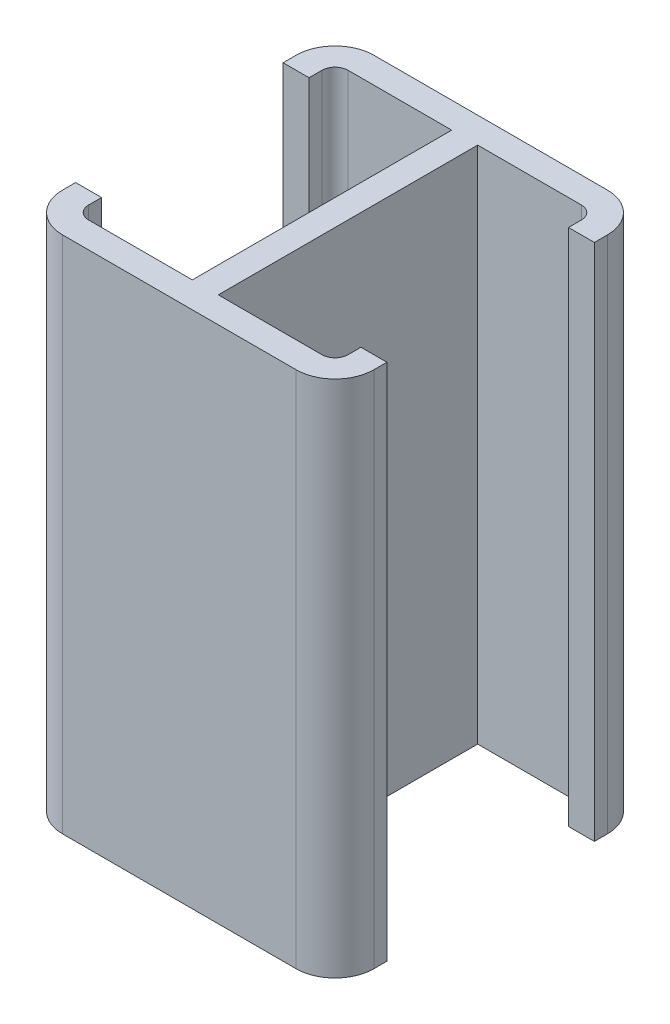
ISO-10303-21;
HEADER;
FILE_DESCRIPTION(('STEP AP214'),'2;1');
FILE_NAME('part.step','',(''),(''),'','','');
FILE_SCHEMA(('AUTOMOTIVE_DESIGN { 1 0 10303 214 1 1 1 1 }'));
ENDSEC;
DATA;
#1=APPLICATION_CONTEXT('core data for automotive mechanical design processes');
#2=APPLICATION_PROTOCOL_DEFINITION('international standard','automotive_design',2000,#1);
#3=PRODUCT_CONTEXT('',#1,'mechanical');
#4=PRODUCT('Part','Part','',(#3));
#5=PRODUCT_RELATED_PRODUCT_CATEGORY('part','',(#4));
#6=PRODUCT_DEFINITION_FORMATION('','',#4);
#7=PRODUCT_DEFINITION_CONTEXT('part definition',#1,'design');
#8=PRODUCT_DEFINITION('design','',#6,#7);
#9=PRODUCT_DEFINITION_SHAPE('','',#8);
#10=(LENGTH_UNIT() NAMED_UNIT(*) SI_UNIT(.MILLI.,.METRE.));
#11=(NAMED_UNIT(*) PLANE_ANGLE_UNIT() SI_UNIT($,.RADIAN.));
#12=(NAMED_UNIT(*) SI_UNIT($,.STERADIAN.) SOLID_ANGLE_UNIT());
#13=UNCERTAINTY_MEASURE_WITH_UNIT(LENGTH_MEASURE(1.E-05),#10,'distance_accuracy_value','');
#14=(GEOMETRIC_REPRESENTATION_CONTEXT(3) GLOBAL_UNCERTAINTY_ASSIGNED_CONTEXT((#13)) GLOBAL_UNIT_ASSIGNED_CONTEXT((#10,
#11,#12)) REPRESENTATION_CONTEXT('',''));
#15=CARTESIAN_POINT('',(0.,0.,0.));
#16=DIRECTION('',(0.,0.,1.));
#17=DIRECTION('',(1.,0.,0.));
#18=AXIS2_PLACEMENT_3D('',#15,#16,#17);
#19=CARTESIAN_POINT('',(0.,200.,60.));
#20=DIRECTION('',(0.,0.,-1.));
#21=DIRECTION('',(-1.,0.,0.));
#22=AXIS2_PLACEMENT_3D('',#19,#20,#21);
#23=PLANE('',#22);
#24=DIRECTION('',(1.,0.,0.));
#25=VECTOR('',#24,1.);
#26=CARTESIAN_POINT('',(0.,0.,60.));
#27=LINE('',#26,#25);
#28=CARTESIAN_POINT('',(-45.,0.,60.));
#29=VERTEX_POINT('',#28);
#30=CARTESIAN_POINT('',(45.,0.,60.));
#31=VERTEX_POINT('',#30);
#32=EDGE_CURVE('E129',#29,#31,#27,.T.);
#33=ORIENTED_EDGE('',*,*,#32,.T.);
#34=DIRECTION('',(0.,-1.,0.));
#35=VECTOR('',#34,1.);
#36=CARTESIAN_POINT('',(45.,200.,60.));
#37=LINE('',#36,#35);
#38=CARTESIAN_POINT('',(45.,200.,60.));
#39=VERTEX_POINT('',#38);
#40=EDGE_CURVE('E11',#39,#31,#37,.T.);
#41=ORIENTED_EDGE('',*,*,#40,.F.);
#42=DIRECTION('',(1.,0.,0.));
#43=VECTOR('',#42,1.);
#44=CARTESIAN_POINT('',(0.,200.,60.));
#45=LINE('',#44,#43);
#46=CARTESIAN_POINT('',(-45.,200.,60.));
#47=VERTEX_POINT('',#46);
#48=EDGE_CURVE('E89',#47,#39,#45,.T.);
#49=ORIENTED_EDGE('',*,*,#48,.F.);
#50=DIRECTION('',(0.,-1.,0.));
#51=VECTOR('',#50,1.);
#52=CARTESIAN_POINT('',(-45.,200.,60.));
#53=LINE('',#52,#51);
#54=EDGE_CURVE('E132',#47,#29,#53,.T.);
#55=ORIENTED_EDGE('',*,*,#54,.T.);
#56=EDGE_LOOP('',(#33,#41,#49,#55));
#57=FACE_BOUND('',#56,.T.);
#58=ADVANCED_FACE('F32',(#57),#23,.F.);
#59=CARTESIAN_POINT('',(45.,200.,45.));
#60=DIRECTION('',(0.,-1.,0.));
#61=DIRECTION('',(0.,0.,-1.));
#62=AXIS2_PLACEMENT_3D('',#59,#60,#61);
#63=CYLINDRICAL_SURFACE('',#62,15.);
#64=CARTESIAN_POINT('',(45.,0.,45.));
#65=DIRECTION('',(0.,1.,0.));
#66=DIRECTION('',(0.,0.,-1.));
#67=AXIS2_PLACEMENT_3D('',#64,#65,#66);
#68=CIRCLE('',#67,15.);
#69=CARTESIAN_POINT('',(60.,0.,45.));
#70=VERTEX_POINT('',#69);
#71=EDGE_CURVE('E131',#31,#70,#68,.T.);
#72=ORIENTED_EDGE('',*,*,#71,.T.);
#73=DIRECTION('',(0.,-1.,0.));
#74=VECTOR('',#73,1.);
#75=CARTESIAN_POINT('',(60.,200.,45.));
#76=LINE('',#75,#74);
#77=CARTESIAN_POINT('',(60.,200.,45.));
#78=VERTEX_POINT('',#77);
#79=EDGE_CURVE('E40',#78,#70,#76,.T.);
#80=ORIENTED_EDGE('',*,*,#79,.F.);
#81=CARTESIAN_POINT('',(45.,200.,45.));
#82=DIRECTION('',(0.,1.,0.));
#83=DIRECTION('',(0.,0.,-1.));
#84=AXIS2_PLACEMENT_3D('',#81,#82,#83);
#85=CIRCLE('',#84,15.);
#86=EDGE_CURVE('E167',#39,#78,#85,.T.);
#87=ORIENTED_EDGE('',*,*,#86,.F.);
#88=ORIENTED_EDGE('',*,*,#40,.T.);
#89=EDGE_LOOP('',(#72,#80,#87,#88));
#90=FACE_BOUND('',#89,.T.);
#91=ADVANCED_FACE('F512',(#90),#63,.T.);
#92=CARTESIAN_POINT('',(60.,200.,45.));
#93=DIRECTION('',(-1.,0.,0.));
#94=DIRECTION('',(0.,0.,1.));
#95=AXIS2_PLACEMENT_3D('',#92,#93,#94);
#96=PLANE('',#95);
#97=DIRECTION('',(0.,0.,-1.));
#98=VECTOR('',#97,1.);
#99=CARTESIAN_POINT('',(60.,0.,45.));
#100=LINE('',#99,#98);
#101=CARTESIAN_POINT('',(60.,0.,40.));
#102=VERTEX_POINT('',#101);
#103=EDGE_CURVE('E134',#70,#102,#100,.T.);
#104=ORIENTED_EDGE('',*,*,#103,.T.);
#105=DIRECTION('',(0.,-1.,0.));
#106=VECTOR('',#105,1.);
#107=CARTESIAN_POINT('',(60.,200.,40.));
#108=LINE('',#107,#106);
#109=CARTESIAN_POINT('',(60.,200.,40.));
#110=VERTEX_POINT('',#109);
#111=EDGE_CURVE('E147',#110,#102,#108,.T.);
#112=ORIENTED_EDGE('',*,*,#111,.F.);
#113=DIRECTION('',(0.,0.,-1.));
#114=VECTOR('',#113,1.);
#115=CARTESIAN_POINT('',(60.,200.,45.));
#116=LINE('',#115,#114);
#117=EDGE_CURVE('E156',#78,#110,#116,.T.);
#118=ORIENTED_EDGE('',*,*,#117,.F.);
#119=ORIENTED_EDGE('',*,*,#79,.T.);
#120=EDGE_LOOP('',(#104,#112,#118,#119));
#121=FACE_BOUND('',#120,.T.);
#122=ADVANCED_FACE('F154',(#121),#96,.F.);
#123=CARTESIAN_POINT('',(60.,200.,40.));
#124=DIRECTION('',(0.,0.,1.));
#125=DIRECTION('',(1.,0.,0.));
#126=AXIS2_PLACEMENT_3D('',#123,#124,#125);
#127=PLANE('',#126);
#128=DIRECTION('',(-1.,0.,0.));
#129=VECTOR('',#128,1.);
#130=CARTESIAN_POINT('',(60.,0.,40.));
#131=LINE('',#130,#129);
#132=CARTESIAN_POINT('',(50.,0.,40.));
#133=VERTEX_POINT('',#132);
#134=EDGE_CURVE('E136',#102,#133,#131,.T.);
#135=ORIENTED_EDGE('',*,*,#134,.T.);
#136=DIRECTION('',(0.,-1.,0.));
#137=VECTOR('',#136,1.);
#138=CARTESIAN_POINT('',(50.,200.,40.));
#139=LINE('',#138,#137);
#140=CARTESIAN_POINT('',(50.,200.,40.));
#141=VERTEX_POINT('',#140);
#142=EDGE_CURVE('E118',#141,#133,#139,.T.);
#143=ORIENTED_EDGE('',*,*,#142,.F.);
#144=DIRECTION('',(-1.,0.,0.));
#145=VECTOR('',#144,1.);
#146=CARTESIAN_POINT('',(60.,200.,40.));
#147=LINE('',#146,#145);
#148=EDGE_CURVE('E109',#110,#141,#147,.T.);
#149=ORIENTED_EDGE('',*,*,#148,.F.);
#150=ORIENTED_EDGE('',*,*,#111,.T.);
#151=EDGE_LOOP('',(#135,#143,#149,#150));
#152=FACE_BOUND('',#151,.T.);
#153=ADVANCED_FACE('F166',(#152),#127,.F.);
#154=CARTESIAN_POINT('',(50.,200.,40.));
#155=DIRECTION('',(1.,0.,0.));
#156=DIRECTION('',(0.,0.,-1.));
#157=AXIS2_PLACEMENT_3D('',#154,#155,#156);
#158=PLANE('',#157);
#159=DIRECTION('',(0.,0.,1.));
#160=VECTOR('',#159,1.);
#161=CARTESIAN_POINT('',(50.,0.,40.));
#162=LINE('',#161,#160);
#163=CARTESIAN_POINT('',(50.,0.,45.));
#164=VERTEX_POINT('',#163);
#165=EDGE_CURVE('E117',#133,#164,#162,.T.);
#166=ORIENTED_EDGE('',*,*,#165,.T.);
#167=DIRECTION('',(0.,-1.,0.));
#168=VECTOR('',#167,1.);
#169=CARTESIAN_POINT('',(50.,200.,45.));
#170=LINE('',#169,#168);
#171=CARTESIAN_POINT('',(50.,200.,45.));
#172=VERTEX_POINT('',#171);
#173=EDGE_CURVE('E114',#172,#164,#170,.T.);
#174=ORIENTED_EDGE('',*,*,#173,.F.);
#175=DIRECTION('',(0.,0.,1.));
#176=VECTOR('',#175,1.);
#177=CARTESIAN_POINT('',(50.,200.,40.));
#178=LINE('',#177,#176);
#179=EDGE_CURVE('E103',#141,#172,#178,.T.);
#180=ORIENTED_EDGE('',*,*,#179,.F.);
#181=ORIENTED_EDGE('',*,*,#142,.T.);
#182=EDGE_LOOP('',(#166,#174,#180,#181));
#183=FACE_BOUND('',#182,.T.);
#184=ADVANCED_FACE('F115',(#183),#158,.F.);
#185=CARTESIAN_POINT('',(45.,200.,45.));
#186=DIRECTION('',(0.,-1.,0.));
#187=DIRECTION('',(0.,0.,-1.));
#188=AXIS2_PLACEMENT_3D('',#185,#186,#187);
#189=CYLINDRICAL_SURFACE('',#188,5.);
#190=CARTESIAN_POINT('',(45.,0.,45.));
#191=DIRECTION('',(0.,-1.,0.));
#192=DIRECTION('',(0.,0.,-1.));
#193=AXIS2_PLACEMENT_3D('',#190,#191,#192);
#194=CIRCLE('',#193,5.);
#195=CARTESIAN_POINT('',(45.,0.,50.));
#196=VERTEX_POINT('',#195);
#197=EDGE_CURVE('E75',#164,#196,#194,.T.);
#198=ORIENTED_EDGE('',*,*,#197,.T.);
#199=DIRECTION('',(0.,-1.,0.));
#200=VECTOR('',#199,1.);
#201=CARTESIAN_POINT('',(45.,200.,50.));
#202=LINE('',#201,#200);
#203=CARTESIAN_POINT('',(45.,200.,50.));
#204=VERTEX_POINT('',#203);
#205=EDGE_CURVE('E119',#204,#196,#202,.T.);
#206=ORIENTED_EDGE('',*,*,#205,.F.);
#207=CARTESIAN_POINT('',(45.,200.,45.));
#208=DIRECTION('',(0.,-1.,0.));
#209=DIRECTION('',(0.,0.,-1.));
#210=AXIS2_PLACEMENT_3D('',#207,#208,#209);
#211=CIRCLE('',#210,5.);
#212=EDGE_CURVE('E107',#172,#204,#211,.T.);
#213=ORIENTED_EDGE('',*,*,#212,.F.);
#214=ORIENTED_EDGE('',*,*,#173,.T.);
#215=EDGE_LOOP('',(#198,#206,#213,#214));
#216=FACE_BOUND('',#215,.T.);
#217=ADVANCED_FACE('F121',(#216),#189,.F.);
#218=CARTESIAN_POINT('',(45.,200.,50.));
#219=DIRECTION('',(0.,0.,1.));
#220=DIRECTION('',(1.,0.,0.));
#221=AXIS2_PLACEMENT_3D('',#218,#219,#220);
#222=PLANE('',#221);
#223=DIRECTION('',(-1.,0.,0.));
#224=VECTOR('',#223,1.);
#225=CARTESIAN_POINT('',(45.,0.,50.));
#226=LINE('',#225,#224);
#227=CARTESIAN_POINT('',(5.,0.,50.));
#228=VERTEX_POINT('',#227);
#229=EDGE_CURVE('E81',#196,#228,#226,.T.);
#230=ORIENTED_EDGE('',*,*,#229,.T.);
#231=DIRECTION('',(0.,-1.,0.));
#232=VECTOR('',#231,1.);
#233=CARTESIAN_POINT('',(5.,200.,50.));
#234=LINE('',#233,#232);
#235=CARTESIAN_POINT('',(5.,200.,50.));
#236=VERTEX_POINT('',#235);
#237=EDGE_CURVE('E128',#236,#228,#234,.T.);
#238=ORIENTED_EDGE('',*,*,#237,.F.);
#239=DIRECTION('',(-1.,0.,0.));
#240=VECTOR('',#239,1.);
#241=CARTESIAN_POINT('',(45.,200.,50.));
#242=LINE('',#241,#240);
#243=EDGE_CURVE('E48',#204,#236,#242,.T.);
#244=ORIENTED_EDGE('',*,*,#243,.F.);
#245=ORIENTED_EDGE('',*,*,#205,.T.);
#246=EDGE_LOOP('',(#230,#238,#244,#245));
#247=FACE_BOUND('',#246,.T.);
#248=ADVANCED_FACE('F545',(#247),#222,.F.);
#249=CARTESIAN_POINT('',(5.,200.,50.));
#250=DIRECTION('',(-1.,0.,0.));
#251=DIRECTION('',(0.,0.,1.));
#252=AXIS2_PLACEMENT_3D('',#249,#250,#251);
#253=PLANE('',#252);
#254=DIRECTION('',(0.,0.,-1.));
#255=VECTOR('',#254,1.);
#256=CARTESIAN_POINT('',(5.,0.,50.));
#257=LINE('',#256,#255);
#258=CARTESIAN_POINT('',(5.00000000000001,0.,-50.));
#259=VERTEX_POINT('',#258);
#260=EDGE_CURVE('E141',#228,#259,#257,.T.);
#261=ORIENTED_EDGE('',*,*,#260,.T.);
#262=DIRECTION('',(0.,-1.,0.));
#263=VECTOR('',#262,1.);
#264=CARTESIAN_POINT('',(5.00000000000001,200.,-50.));
#265=LINE('',#264,#263);
#266=CARTESIAN_POINT('',(5.00000000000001,200.,-50.));
#267=VERTEX_POINT('',#266);
#268=EDGE_CURVE('E251',#267,#259,#265,.T.);
#269=ORIENTED_EDGE('',*,*,#268,.F.);
#270=DIRECTION('',(0.,0.,-1.));
#271=VECTOR('',#270,1.);
#272=CARTESIAN_POINT('',(5.,200.,50.));
#273=LINE('',#272,#271);
#274=EDGE_CURVE('E123',#236,#267,#273,.T.);
#275=ORIENTED_EDGE('',*,*,#274,.F.);
#276=ORIENTED_EDGE('',*,*,#237,.T.);
#277=EDGE_LOOP('',(#261,#269,#275,#276));
#278=FACE_BOUND('',#277,.T.);
#279=ADVANCED_FACE('F540',(#278),#253,.F.);
#280=CARTESIAN_POINT('',(45.,200.,45.));
#281=DIRECTION('',(0.,-1.,0.));
#282=DIRECTION('',(0.,0.,-1.));
#283=AXIS2_PLACEMENT_3D('',#280,#281,#282);
#284=PLANE('',#283);
#285=ORIENTED_EDGE('',*,*,#274,.T.);
#286=DIRECTION('',(-1.,0.,0.));
#287=VECTOR('',#286,1.);
#288=CARTESIAN_POINT('',(45.,200.,-50.));
#289=LINE('',#288,#287);
#290=CARTESIAN_POINT('',(45.,200.,-50.));
#291=VERTEX_POINT('',#290);
#292=EDGE_CURVE('E254',#291,#267,#289,.T.);
#293=ORIENTED_EDGE('',*,*,#292,.F.);
#294=CARTESIAN_POINT('',(45.,200.,-45.));
#295=DIRECTION('',(0.,1.,0.));
#296=DIRECTION('',(0.,0.,1.));
#297=AXIS2_PLACEMENT_3D('',#294,#295,#296);
#298=CIRCLE('',#297,5.);
#299=CARTESIAN_POINT('',(50.,200.,-45.));
#300=VERTEX_POINT('',#299);
#301=EDGE_CURVE('E280',#300,#291,#298,.T.);
#302=ORIENTED_EDGE('',*,*,#301,.F.);
#303=DIRECTION('',(0.,0.,-1.));
#304=VECTOR('',#303,1.);
#305=CARTESIAN_POINT('',(50.,200.,-40.));
#306=LINE('',#305,#304);
#307=CARTESIAN_POINT('',(50.,200.,-40.));
#308=VERTEX_POINT('',#307);
#309=EDGE_CURVE('E283',#308,#300,#306,.T.);
#310=ORIENTED_EDGE('',*,*,#309,.F.);
#311=DIRECTION('',(-1.,0.,0.));
#312=VECTOR('',#311,1.);
#313=CARTESIAN_POINT('',(60.,200.,-40.));
#314=LINE('',#313,#312);
#315=CARTESIAN_POINT('',(60.,200.,-40.));
#316=VERTEX_POINT('',#315);
#317=EDGE_CURVE('E286',#316,#308,#314,.T.);
#318=ORIENTED_EDGE('',*,*,#317,.F.);
#319=DIRECTION('',(0.,0.,1.));
#320=VECTOR('',#319,1.);
#321=CARTESIAN_POINT('',(60.,200.,-45.));
#322=LINE('',#321,#320);
#323=CARTESIAN_POINT('',(60.,200.,-45.));
#324=VERTEX_POINT('',#323);
#325=EDGE_CURVE('E289',#324,#316,#322,.T.);
#326=ORIENTED_EDGE('',*,*,#325,.F.);
#327=CARTESIAN_POINT('',(45.,200.,-45.));
#328=DIRECTION('',(0.,-1.,0.));
#329=DIRECTION('',(0.,0.,1.));
#330=AXIS2_PLACEMENT_3D('',#327,#328,#329);
#331=CIRCLE('',#330,15.);
#332=CARTESIAN_POINT('',(45.,200.,-60.));
#333=VERTEX_POINT('',#332);
#334=EDGE_CURVE('E292',#333,#324,#331,.T.);
#335=ORIENTED_EDGE('',*,*,#334,.F.);
#336=DIRECTION('',(1.,0.,0.));
#337=VECTOR('',#336,1.);
#338=CARTESIAN_POINT('',(0.,200.,-60.));
#339=LINE('',#338,#337);
#340=CARTESIAN_POINT('',(-45.,200.,-60.));
#341=VERTEX_POINT('',#340);
#342=EDGE_CURVE('E258',#341,#333,#339,.T.);
#343=ORIENTED_EDGE('',*,*,#342,.F.);
#344=CARTESIAN_POINT('',(-45.,200.,-45.));
#345=DIRECTION('',(0.,1.,0.));
#346=DIRECTION('',(0.,0.,1.));
#347=AXIS2_PLACEMENT_3D('',#344,#345,#346);
#348=CIRCLE('',#347,15.);
#349=CARTESIAN_POINT('',(-60.,200.,-45.));
#350=VERTEX_POINT('',#349);
#351=EDGE_CURVE('E321',#341,#350,#348,.T.);
#352=ORIENTED_EDGE('',*,*,#351,.T.);
#353=DIRECTION('',(0.,0.,1.));
#354=VECTOR('',#353,1.);
#355=CARTESIAN_POINT('',(-60.,200.,-45.));
#356=LINE('',#355,#354);
#357=CARTESIAN_POINT('',(-60.,200.,-40.));
#358=VERTEX_POINT('',#357);
#359=EDGE_CURVE('E348',#350,#358,#356,.T.);
#360=ORIENTED_EDGE('',*,*,#359,.T.);
#361=DIRECTION('',(1.,0.,0.));
#362=VECTOR('',#361,1.);
#363=CARTESIAN_POINT('',(-60.,200.,-40.));
#364=LINE('',#363,#362);
#365=CARTESIAN_POINT('',(-50.,200.,-40.));
#366=VERTEX_POINT('',#365);
#367=EDGE_CURVE('E345',#358,#366,#364,.T.);
#368=ORIENTED_EDGE('',*,*,#367,.T.);
#369=DIRECTION('',(0.,0.,-1.));
#370=VECTOR('',#369,1.);
#371=CARTESIAN_POINT('',(-50.,200.,-40.));
#372=LINE('',#371,#370);
#373=CARTESIAN_POINT('',(-50.,200.,-45.));
#374=VERTEX_POINT('',#373);
#375=EDGE_CURVE('E342',#366,#374,#372,.T.);
#376=ORIENTED_EDGE('',*,*,#375,.T.);
#377=CARTESIAN_POINT('',(-45.,200.,-45.));
#378=DIRECTION('',(0.,-1.,0.));
#379=DIRECTION('',(0.,0.,1.));
#380=AXIS2_PLACEMENT_3D('',#377,#378,#379);
#381=CIRCLE('',#380,5.);
#382=CARTESIAN_POINT('',(-45.,200.,-50.));
#383=VERTEX_POINT('',#382);
#384=EDGE_CURVE('E339',#374,#383,#381,.T.);
#385=ORIENTED_EDGE('',*,*,#384,.T.);
#386=DIRECTION('',(1.,0.,0.));
#387=VECTOR('',#386,1.);
#388=CARTESIAN_POINT('',(-45.,200.,-50.));
#389=LINE('',#388,#387);
#390=CARTESIAN_POINT('',(-4.99999999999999,200.,-50.));
#391=VERTEX_POINT('',#390);
#392=EDGE_CURVE('E317',#383,#391,#389,.T.);
#393=ORIENTED_EDGE('',*,*,#392,.T.);
#394=DIRECTION('',(0.,0.,-1.));
#395=VECTOR('',#394,1.);
#396=CARTESIAN_POINT('',(-5.,200.,50.));
#397=LINE('',#396,#395);
#398=CARTESIAN_POINT('',(-5.,200.,50.));
#399=VERTEX_POINT('',#398);
#400=EDGE_CURVE('E192',#399,#391,#397,.T.);
#401=ORIENTED_EDGE('',*,*,#400,.F.);
#402=DIRECTION('',(1.,0.,0.));
#403=VECTOR('',#402,1.);
#404=CARTESIAN_POINT('',(-45.,200.,50.));
#405=LINE('',#404,#403);
#406=CARTESIAN_POINT('',(-45.,200.,50.));
#407=VERTEX_POINT('',#406);
#408=EDGE_CURVE('E217',#407,#399,#405,.T.);
#409=ORIENTED_EDGE('',*,*,#408,.F.);
#410=CARTESIAN_POINT('',(-45.,200.,45.));
#411=DIRECTION('',(0.,1.,0.));
#412=DIRECTION('',(0.,0.,-1.));
#413=AXIS2_PLACEMENT_3D('',#410,#411,#412);
#414=CIRCLE('',#413,5.);
#415=CARTESIAN_POINT('',(-50.,200.,45.));
#416=VERTEX_POINT('',#415);
#417=EDGE_CURVE('E220',#416,#407,#414,.T.);
#418=ORIENTED_EDGE('',*,*,#417,.F.);
#419=DIRECTION('',(0.,0.,1.));
#420=VECTOR('',#419,1.);
#421=CARTESIAN_POINT('',(-50.,200.,40.));
#422=LINE('',#421,#420);
#423=CARTESIAN_POINT('',(-50.,200.,40.));
#424=VERTEX_POINT('',#423);
#425=EDGE_CURVE('E223',#424,#416,#422,.T.);
#426=ORIENTED_EDGE('',*,*,#425,.F.);
#427=DIRECTION('',(1.,0.,0.));
#428=VECTOR('',#427,1.);
#429=CARTESIAN_POINT('',(-60.,200.,40.));
#430=LINE('',#429,#428);
#431=CARTESIAN_POINT('',(-60.,200.,40.));
#432=VERTEX_POINT('',#431);
#433=EDGE_CURVE('E226',#432,#424,#430,.T.);
#434=ORIENTED_EDGE('',*,*,#433,.F.);
#435=DIRECTION('',(0.,0.,-1.));
#436=VECTOR('',#435,1.);
#437=CARTESIAN_POINT('',(-60.,200.,45.));
#438=LINE('',#437,#436);
#439=CARTESIAN_POINT('',(-60.,200.,45.));
#440=VERTEX_POINT('',#439);
#441=EDGE_CURVE('E229',#440,#432,#438,.T.);
#442=ORIENTED_EDGE('',*,*,#441,.F.);
#443=CARTESIAN_POINT('',(-45.,200.,45.));
#444=DIRECTION('',(0.,-1.,0.));
#445=DIRECTION('',(0.,0.,-1.));
#446=AXIS2_PLACEMENT_3D('',#443,#444,#445);
#447=CIRCLE('',#446,15.);
#448=EDGE_CURVE('E195',#47,#440,#447,.T.);
#449=ORIENTED_EDGE('',*,*,#448,.F.);
#450=ORIENTED_EDGE('',*,*,#48,.T.);
#451=ORIENTED_EDGE('',*,*,#86,.T.);
#452=ORIENTED_EDGE('',*,*,#117,.T.);
#453=ORIENTED_EDGE('',*,*,#148,.T.);
#454=ORIENTED_EDGE('',*,*,#179,.T.);
#455=ORIENTED_EDGE('',*,*,#212,.T.);
#456=ORIENTED_EDGE('',*,*,#243,.T.);
#457=EDGE_LOOP('',(#285,#293,#302,#310,#318,#326,#335,#343,#352,#360,#368,#376,#385,#393,#401,
#409,#418,#426,#434,#442,#449,#450,#451,#452,#453,#454,#455,#456));
#458=FACE_BOUND('',#457,.T.);
#459=ADVANCED_FACE('F105',(#458),#284,.F.);
#460=CARTESIAN_POINT('',(45.,0.,45.));
#461=DIRECTION('',(0.,-1.,0.));
#462=DIRECTION('',(0.,0.,-1.));
#463=AXIS2_PLACEMENT_3D('',#460,#461,#462);
#464=PLANE('',#463);
#465=DIRECTION('',(0.,0.,-1.));
#466=VECTOR('',#465,1.);
#467=CARTESIAN_POINT('',(-5.,0.,50.));
#468=LINE('',#467,#466);
#469=CARTESIAN_POINT('',(-5.,0.,50.));
#470=VERTEX_POINT('',#469);
#471=CARTESIAN_POINT('',(-4.99999999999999,0.,-50.));
#472=VERTEX_POINT('',#471);
#473=EDGE_CURVE('E193',#470,#472,#468,.T.);
#474=ORIENTED_EDGE('',*,*,#473,.T.);
#475=DIRECTION('',(1.,0.,0.));
#476=VECTOR('',#475,1.);
#477=CARTESIAN_POINT('',(-45.,0.,-50.));
#478=LINE('',#477,#476);
#479=CARTESIAN_POINT('',(-45.,0.,-50.));
#480=VERTEX_POINT('',#479);
#481=EDGE_CURVE('E318',#480,#472,#478,.T.);
#482=ORIENTED_EDGE('',*,*,#481,.F.);
#483=CARTESIAN_POINT('',(-45.,0.,-45.));
#484=DIRECTION('',(0.,-1.,0.));
#485=DIRECTION('',(0.,0.,1.));
#486=AXIS2_PLACEMENT_3D('',#483,#484,#485);
#487=CIRCLE('',#486,5.);
#488=CARTESIAN_POINT('',(-50.,0.,-45.));
#489=VERTEX_POINT('',#488);
#490=EDGE_CURVE('E322',#489,#480,#487,.T.);
#491=ORIENTED_EDGE('',*,*,#490,.F.);
#492=DIRECTION('',(0.,0.,-1.));
#493=VECTOR('',#492,1.);
#494=CARTESIAN_POINT('',(-50.,0.,-40.));
#495=LINE('',#494,#493);
#496=CARTESIAN_POINT('',(-50.,0.,-40.));
#497=VERTEX_POINT('',#496);
#498=EDGE_CURVE('E325',#497,#489,#495,.T.);
#499=ORIENTED_EDGE('',*,*,#498,.F.);
#500=DIRECTION('',(1.,0.,0.));
#501=VECTOR('',#500,1.);
#502=CARTESIAN_POINT('',(-60.,0.,-40.));
#503=LINE('',#502,#501);
#504=CARTESIAN_POINT('',(-60.,0.,-40.));
#505=VERTEX_POINT('',#504);
#506=EDGE_CURVE('E328',#505,#497,#503,.T.);
#507=ORIENTED_EDGE('',*,*,#506,.F.);
#508=DIRECTION('',(0.,0.,1.));
#509=VECTOR('',#508,1.);
#510=CARTESIAN_POINT('',(-60.,0.,-45.));
#511=LINE('',#510,#509);
#512=CARTESIAN_POINT('',(-60.,0.,-45.));
#513=VERTEX_POINT('',#512);
#514=EDGE_CURVE('E331',#513,#505,#511,.T.);
#515=ORIENTED_EDGE('',*,*,#514,.F.);
#516=CARTESIAN_POINT('',(-45.,0.,-45.));
#517=DIRECTION('',(0.,1.,0.));
#518=DIRECTION('',(0.,0.,1.));
#519=AXIS2_PLACEMENT_3D('',#516,#517,#518);
#520=CIRCLE('',#519,15.);
#521=CARTESIAN_POINT('',(-45.,0.,-60.));
#522=VERTEX_POINT('',#521);
#523=EDGE_CURVE('E334',#522,#513,#520,.T.);
#524=ORIENTED_EDGE('',*,*,#523,.F.);
#525=DIRECTION('',(1.,0.,0.));
#526=VECTOR('',#525,1.);
#527=CARTESIAN_POINT('',(0.,0.,-60.));
#528=LINE('',#527,#526);
#529=CARTESIAN_POINT('',(45.,0.,-60.));
#530=VERTEX_POINT('',#529);
#531=EDGE_CURVE('E274',#522,#530,#528,.T.);
#532=ORIENTED_EDGE('',*,*,#531,.T.);
#533=CARTESIAN_POINT('',(45.,0.,-45.));
#534=DIRECTION('',(0.,-1.,0.));
#535=DIRECTION('',(0.,0.,1.));
#536=AXIS2_PLACEMENT_3D('',#533,#534,#535);
#537=CIRCLE('',#536,15.);
#538=CARTESIAN_POINT('',(60.,0.,-45.));
#539=VERTEX_POINT('',#538);
#540=EDGE_CURVE('E271',#530,#539,#537,.T.);
#541=ORIENTED_EDGE('',*,*,#540,.T.);
#542=DIRECTION('',(0.,0.,1.));
#543=VECTOR('',#542,1.);
#544=CARTESIAN_POINT('',(60.,0.,-45.));
#545=LINE('',#544,#543);
#546=CARTESIAN_POINT('',(60.,0.,-40.));
#547=VERTEX_POINT('',#546);
#548=EDGE_CURVE('E268',#539,#547,#545,.T.);
#549=ORIENTED_EDGE('',*,*,#548,.T.);
#550=DIRECTION('',(-1.,0.,0.));
#551=VECTOR('',#550,1.);
#552=CARTESIAN_POINT('',(60.,0.,-40.));
#553=LINE('',#552,#551);
#554=CARTESIAN_POINT('',(50.,0.,-40.));
#555=VERTEX_POINT('',#554);
#556=EDGE_CURVE('E265',#547,#555,#553,.T.);
#557=ORIENTED_EDGE('',*,*,#556,.T.);
#558=DIRECTION('',(0.,0.,-1.));
#559=VECTOR('',#558,1.);
#560=CARTESIAN_POINT('',(50.,0.,-40.));
#561=LINE('',#560,#559);
#562=CARTESIAN_POINT('',(50.,0.,-45.));
#563=VERTEX_POINT('',#562);
#564=EDGE_CURVE('E262',#555,#563,#561,.T.);
#565=ORIENTED_EDGE('',*,*,#564,.T.);
#566=CARTESIAN_POINT('',(45.,0.,-45.));
#567=DIRECTION('',(0.,1.,0.));
#568=DIRECTION('',(0.,0.,1.));
#569=AXIS2_PLACEMENT_3D('',#566,#567,#568);
#570=CIRCLE('',#569,5.);
#571=CARTESIAN_POINT('',(45.,0.,-50.));
#572=VERTEX_POINT('',#571);
#573=EDGE_CURVE('E259',#563,#572,#570,.T.);
#574=ORIENTED_EDGE('',*,*,#573,.T.);
#575=DIRECTION('',(-1.,0.,0.));
#576=VECTOR('',#575,1.);
#577=CARTESIAN_POINT('',(45.,0.,-50.));
#578=LINE('',#577,#576);
#579=EDGE_CURVE('E255',#572,#259,#578,.T.);
#580=ORIENTED_EDGE('',*,*,#579,.T.);
#581=ORIENTED_EDGE('',*,*,#260,.F.);
#582=ORIENTED_EDGE('',*,*,#229,.F.);
#583=ORIENTED_EDGE('',*,*,#197,.F.);
#584=ORIENTED_EDGE('',*,*,#165,.F.);
#585=ORIENTED_EDGE('',*,*,#134,.F.);
#586=ORIENTED_EDGE('',*,*,#103,.F.);
#587=ORIENTED_EDGE('',*,*,#71,.F.);
#588=ORIENTED_EDGE('',*,*,#32,.F.);
#589=CARTESIAN_POINT('',(-45.,0.,45.));
#590=DIRECTION('',(0.,-1.,0.));
#591=DIRECTION('',(0.,0.,-1.));
#592=AXIS2_PLACEMENT_3D('',#589,#590,#591);
#593=CIRCLE('',#592,15.);
#594=CARTESIAN_POINT('',(-60.,0.,45.));
#595=VERTEX_POINT('',#594);
#596=EDGE_CURVE('E211',#29,#595,#593,.T.);
#597=ORIENTED_EDGE('',*,*,#596,.T.);
#598=DIRECTION('',(0.,0.,-1.));
#599=VECTOR('',#598,1.);
#600=CARTESIAN_POINT('',(-60.,0.,45.));
#601=LINE('',#600,#599);
#602=CARTESIAN_POINT('',(-60.,0.,40.));
#603=VERTEX_POINT('',#602);
#604=EDGE_CURVE('E208',#595,#603,#601,.T.);
#605=ORIENTED_EDGE('',*,*,#604,.T.);
#606=DIRECTION('',(1.,0.,0.));
#607=VECTOR('',#606,1.);
#608=CARTESIAN_POINT('',(-60.,0.,40.));
#609=LINE('',#608,#607);
#610=CARTESIAN_POINT('',(-50.,0.,40.));
#611=VERTEX_POINT('',#610);
#612=EDGE_CURVE('E205',#603,#611,#609,.T.);
#613=ORIENTED_EDGE('',*,*,#612,.T.);
#614=DIRECTION('',(0.,0.,1.));
#615=VECTOR('',#614,1.);
#616=CARTESIAN_POINT('',(-50.,0.,40.));
#617=LINE('',#616,#615);
#618=CARTESIAN_POINT('',(-50.,0.,45.));
#619=VERTEX_POINT('',#618);
#620=EDGE_CURVE('E202',#611,#619,#617,.T.);
#621=ORIENTED_EDGE('',*,*,#620,.T.);
#622=CARTESIAN_POINT('',(-45.,0.,45.));
#623=DIRECTION('',(0.,1.,0.));
#624=DIRECTION('',(0.,0.,-1.));
#625=AXIS2_PLACEMENT_3D('',#622,#623,#624);
#626=CIRCLE('',#625,5.);
#627=CARTESIAN_POINT('',(-45.,0.,50.));
#628=VERTEX_POINT('',#627);
#629=EDGE_CURVE('E199',#619,#628,#626,.T.);
#630=ORIENTED_EDGE('',*,*,#629,.T.);
#631=DIRECTION('',(1.,0.,0.));
#632=VECTOR('',#631,1.);
#633=CARTESIAN_POINT('',(-45.,0.,50.));
#634=LINE('',#633,#632);
#635=EDGE_CURVE('E196',#628,#470,#634,.T.);
#636=ORIENTED_EDGE('',*,*,#635,.T.);
#637=EDGE_LOOP('',(#474,#482,#491,#499,#507,#515,#524,#532,#541,#549,#557,#565,#574,#580,#581,
#582,#583,#584,#585,#586,#587,#588,#597,#605,#613,#621,#630,#636));
#638=FACE_BOUND('',#637,.T.);
#639=ADVANCED_FACE('F163',(#638),#464,.T.);
#640=CARTESIAN_POINT('',(-45.,200.,45.));
#641=DIRECTION('',(0.,-1.,0.));
#642=DIRECTION('',(0.,0.,-1.));
#643=AXIS2_PLACEMENT_3D('',#640,#641,#642);
#644=CYLINDRICAL_SURFACE('',#643,15.);
#645=ORIENTED_EDGE('',*,*,#596,.F.);
#646=ORIENTED_EDGE('',*,*,#54,.F.);
#647=ORIENTED_EDGE('',*,*,#448,.T.);
#648=DIRECTION('',(0.,-1.,0.));
#649=VECTOR('',#648,1.);
#650=CARTESIAN_POINT('',(-60.,200.,45.));
#651=LINE('',#650,#649);
#652=EDGE_CURVE('E174',#440,#595,#651,.T.);
#653=ORIENTED_EDGE('',*,*,#652,.T.);
#654=EDGE_LOOP('',(#645,#646,#647,#653));
#655=FACE_BOUND('',#654,.T.);
#656=ADVANCED_FACE('F520',(#655),#644,.T.);
#657=CARTESIAN_POINT('',(-60.,200.,45.));
#658=DIRECTION('',(1.,0.,0.));
#659=DIRECTION('',(0.,0.,1.));
#660=AXIS2_PLACEMENT_3D('',#657,#658,#659);
#661=PLANE('',#660);
#662=ORIENTED_EDGE('',*,*,#604,.F.);
#663=ORIENTED_EDGE('',*,*,#652,.F.);
#664=ORIENTED_EDGE('',*,*,#441,.T.);
#665=DIRECTION('',(0.,-1.,0.));
#666=VECTOR('',#665,1.);
#667=CARTESIAN_POINT('',(-60.,200.,40.));
#668=LINE('',#667,#666);
#669=EDGE_CURVE('E177',#432,#603,#668,.T.);
#670=ORIENTED_EDGE('',*,*,#669,.T.);
#671=EDGE_LOOP('',(#662,#663,#664,#670));
#672=FACE_BOUND('',#671,.T.);
#673=ADVANCED_FACE('F523',(#672),#661,.F.);
#674=CARTESIAN_POINT('',(-60.,200.,40.));
#675=DIRECTION('',(0.,0.,1.));
#676=DIRECTION('',(-1.,0.,0.));
#677=AXIS2_PLACEMENT_3D('',#674,#675,#676);
#678=PLANE('',#677);
#679=ORIENTED_EDGE('',*,*,#612,.F.);
#680=ORIENTED_EDGE('',*,*,#669,.F.);
#681=ORIENTED_EDGE('',*,*,#433,.T.);
#682=DIRECTION('',(0.,-1.,0.));
#683=VECTOR('',#682,1.);
#684=CARTESIAN_POINT('',(-50.,200.,40.));
#685=LINE('',#684,#683);
#686=EDGE_CURVE('E180',#424,#611,#685,.T.);
#687=ORIENTED_EDGE('',*,*,#686,.T.);
#688=EDGE_LOOP('',(#679,#680,#681,#687));
#689=FACE_BOUND('',#688,.T.);
#690=ADVANCED_FACE('F525',(#689),#678,.F.);
#691=CARTESIAN_POINT('',(-50.,200.,40.));
#692=DIRECTION('',(-1.,0.,0.));
#693=DIRECTION('',(0.,0.,-1.));
#694=AXIS2_PLACEMENT_3D('',#691,#692,#693);
#695=PLANE('',#694);
#696=ORIENTED_EDGE('',*,*,#620,.F.);
#697=ORIENTED_EDGE('',*,*,#686,.F.);
#698=ORIENTED_EDGE('',*,*,#425,.T.);
#699=DIRECTION('',(0.,-1.,0.));
#700=VECTOR('',#699,1.);
#701=CARTESIAN_POINT('',(-50.,200.,45.));
#702=LINE('',#701,#700);
#703=EDGE_CURVE('E183',#416,#619,#702,.T.);
#704=ORIENTED_EDGE('',*,*,#703,.T.);
#705=EDGE_LOOP('',(#696,#697,#698,#704));
#706=FACE_BOUND('',#705,.T.);
#707=ADVANCED_FACE('F481',(#706),#695,.F.);
#708=CARTESIAN_POINT('',(-45.,200.,45.));
#709=DIRECTION('',(0.,-1.,0.));
#710=DIRECTION('',(0.,0.,-1.));
#711=AXIS2_PLACEMENT_3D('',#708,#709,#710);
#712=CYLINDRICAL_SURFACE('',#711,5.);
#713=ORIENTED_EDGE('',*,*,#629,.F.);
#714=ORIENTED_EDGE('',*,*,#703,.F.);
#715=ORIENTED_EDGE('',*,*,#417,.T.);
#716=DIRECTION('',(0.,-1.,0.));
#717=VECTOR('',#716,1.);
#718=CARTESIAN_POINT('',(-45.,200.,50.));
#719=LINE('',#718,#717);
#720=EDGE_CURVE('E186',#407,#628,#719,.T.);
#721=ORIENTED_EDGE('',*,*,#720,.T.);
#722=EDGE_LOOP('',(#713,#714,#715,#721));
#723=FACE_BOUND('',#722,.T.);
#724=ADVANCED_FACE('F479',(#723),#712,.F.);
#725=CARTESIAN_POINT('',(-45.,200.,50.));
#726=DIRECTION('',(0.,0.,1.));
#727=DIRECTION('',(-1.,0.,0.));
#728=AXIS2_PLACEMENT_3D('',#725,#726,#727);
#729=PLANE('',#728);
#730=ORIENTED_EDGE('',*,*,#635,.F.);
#731=ORIENTED_EDGE('',*,*,#720,.F.);
#732=ORIENTED_EDGE('',*,*,#408,.T.);
#733=DIRECTION('',(0.,-1.,0.));
#734=VECTOR('',#733,1.);
#735=CARTESIAN_POINT('',(-5.,200.,50.));
#736=LINE('',#735,#734);
#737=EDGE_CURVE('E189',#399,#470,#736,.T.);
#738=ORIENTED_EDGE('',*,*,#737,.T.);
#739=EDGE_LOOP('',(#730,#731,#732,#738));
#740=FACE_BOUND('',#739,.T.);
#741=ADVANCED_FACE('F476',(#740),#729,.F.);
#742=CARTESIAN_POINT('',(-5.,200.,50.));
#743=DIRECTION('',(1.,0.,0.));
#744=DIRECTION('',(0.,0.,1.));
#745=AXIS2_PLACEMENT_3D('',#742,#743,#744);
#746=PLANE('',#745);
#747=ORIENTED_EDGE('',*,*,#473,.F.);
#748=ORIENTED_EDGE('',*,*,#737,.F.);
#749=ORIENTED_EDGE('',*,*,#400,.T.);
#750=DIRECTION('',(0.,-1.,0.));
#751=VECTOR('',#750,1.);
#752=CARTESIAN_POINT('',(-4.99999999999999,200.,-50.));
#753=LINE('',#752,#751);
#754=EDGE_CURVE('E314',#391,#472,#753,.T.);
#755=ORIENTED_EDGE('',*,*,#754,.T.);
#756=EDGE_LOOP('',(#747,#748,#749,#755));
#757=FACE_BOUND('',#756,.T.);
#758=ADVANCED_FACE('F473',(#757),#746,.F.);
#759=CARTESIAN_POINT('',(0.,200.,-60.));
#760=DIRECTION('',(0.,0.,1.));
#761=DIRECTION('',(-1.,0.,0.));
#762=AXIS2_PLACEMENT_3D('',#759,#760,#761);
#763=PLANE('',#762);
#764=ORIENTED_EDGE('',*,*,#531,.F.);
#765=DIRECTION('',(0.,-1.,0.));
#766=VECTOR('',#765,1.);
#767=CARTESIAN_POINT('',(-45.,200.,-60.));
#768=LINE('',#767,#766);
#769=EDGE_CURVE('E277',#341,#522,#768,.T.);
#770=ORIENTED_EDGE('',*,*,#769,.F.);
#771=ORIENTED_EDGE('',*,*,#342,.T.);
#772=DIRECTION('',(0.,-1.,0.));
#773=VECTOR('',#772,1.);
#774=CARTESIAN_POINT('',(45.,200.,-60.));
#775=LINE('',#774,#773);
#776=EDGE_CURVE('E214',#333,#530,#775,.T.);
#777=ORIENTED_EDGE('',*,*,#776,.T.);
#778=EDGE_LOOP('',(#764,#770,#771,#777));
#779=FACE_BOUND('',#778,.T.);
#780=ADVANCED_FACE('F634',(#779),#763,.F.);
#781=CARTESIAN_POINT('',(45.,200.,-45.));
#782=DIRECTION('',(0.,-1.,0.));
#783=DIRECTION('',(0.,0.,1.));
#784=AXIS2_PLACEMENT_3D('',#781,#782,#783);
#785=CYLINDRICAL_SURFACE('',#784,15.);
#786=ORIENTED_EDGE('',*,*,#540,.F.);
#787=ORIENTED_EDGE('',*,*,#776,.F.);
#788=ORIENTED_EDGE('',*,*,#334,.T.);
#789=DIRECTION('',(0.,-1.,0.));
#790=VECTOR('',#789,1.);
#791=CARTESIAN_POINT('',(60.,200.,-45.));
#792=LINE('',#791,#790);
#793=EDGE_CURVE('E236',#324,#539,#792,.T.);
#794=ORIENTED_EDGE('',*,*,#793,.T.);
#795=EDGE_LOOP('',(#786,#787,#788,#794));
#796=FACE_BOUND('',#795,.T.);
#797=ADVANCED_FACE('F691',(#796),#785,.T.);
#798=CARTESIAN_POINT('',(60.,200.,-45.));
#799=DIRECTION('',(-1.,0.,0.));
#800=DIRECTION('',(0.,0.,-1.));
#801=AXIS2_PLACEMENT_3D('',#798,#799,#800);
#802=PLANE('',#801);
#803=ORIENTED_EDGE('',*,*,#548,.F.);
#804=ORIENTED_EDGE('',*,*,#793,.F.);
#805=ORIENTED_EDGE('',*,*,#325,.T.);
#806=DIRECTION('',(0.,-1.,0.));
#807=VECTOR('',#806,1.);
#808=CARTESIAN_POINT('',(60.,200.,-40.));
#809=LINE('',#808,#807);
#810=EDGE_CURVE('E239',#316,#547,#809,.T.);
#811=ORIENTED_EDGE('',*,*,#810,.T.);
#812=EDGE_LOOP('',(#803,#804,#805,#811));
#813=FACE_BOUND('',#812,.T.);
#814=ADVANCED_FACE('F703',(#813),#802,.F.);
#815=CARTESIAN_POINT('',(60.,200.,-40.));
#816=DIRECTION('',(0.,0.,-1.));
#817=DIRECTION('',(1.,0.,0.));
#818=AXIS2_PLACEMENT_3D('',#815,#816,#817);
#819=PLANE('',#818);
#820=ORIENTED_EDGE('',*,*,#556,.F.);
#821=ORIENTED_EDGE('',*,*,#810,.F.);
#822=ORIENTED_EDGE('',*,*,#317,.T.);
#823=DIRECTION('',(0.,-1.,0.));
#824=VECTOR('',#823,1.);
#825=CARTESIAN_POINT('',(50.,200.,-40.));
#826=LINE('',#825,#824);
#827=EDGE_CURVE('E242',#308,#555,#826,.T.);
#828=ORIENTED_EDGE('',*,*,#827,.T.);
#829=EDGE_LOOP('',(#820,#821,#822,#828));
#830=FACE_BOUND('',#829,.T.);
#831=ADVANCED_FACE('F712',(#830),#819,.F.);
#832=CARTESIAN_POINT('',(50.,200.,-40.));
#833=DIRECTION('',(1.,0.,0.));
#834=DIRECTION('',(0.,0.,1.));
#835=AXIS2_PLACEMENT_3D('',#832,#833,#834);
#836=PLANE('',#835);
#837=ORIENTED_EDGE('',*,*,#564,.F.);
#838=ORIENTED_EDGE('',*,*,#827,.F.);
#839=ORIENTED_EDGE('',*,*,#309,.T.);
#840=DIRECTION('',(0.,-1.,0.));
#841=VECTOR('',#840,1.);
#842=CARTESIAN_POINT('',(50.,200.,-45.));
#843=LINE('',#842,#841);
#844=EDGE_CURVE('E245',#300,#563,#843,.T.);
#845=ORIENTED_EDGE('',*,*,#844,.T.);
#846=EDGE_LOOP('',(#837,#838,#839,#845));
#847=FACE_BOUND('',#846,.T.);
#848=ADVANCED_FACE('F721',(#847),#836,.F.);
#849=CARTESIAN_POINT('',(45.,200.,-45.));
#850=DIRECTION('',(0.,-1.,0.));
#851=DIRECTION('',(0.,0.,1.));
#852=AXIS2_PLACEMENT_3D('',#849,#850,#851);
#853=CYLINDRICAL_SURFACE('',#852,5.);
#854=ORIENTED_EDGE('',*,*,#573,.F.);
#855=ORIENTED_EDGE('',*,*,#844,.F.);
#856=ORIENTED_EDGE('',*,*,#301,.T.);
#857=DIRECTION('',(0.,-1.,0.));
#858=VECTOR('',#857,1.);
#859=CARTESIAN_POINT('',(45.,200.,-50.));
#860=LINE('',#859,#858);
#861=EDGE_CURVE('E248',#291,#572,#860,.T.);
#862=ORIENTED_EDGE('',*,*,#861,.T.);
#863=EDGE_LOOP('',(#854,#855,#856,#862));
#864=FACE_BOUND('',#863,.T.);
#865=ADVANCED_FACE('F730',(#864),#853,.F.);
#866=CARTESIAN_POINT('',(45.,200.,-50.));
#867=DIRECTION('',(0.,0.,-1.));
#868=DIRECTION('',(1.,0.,0.));
#869=AXIS2_PLACEMENT_3D('',#866,#867,#868);
#870=PLANE('',#869);
#871=ORIENTED_EDGE('',*,*,#579,.F.);
#872=ORIENTED_EDGE('',*,*,#861,.F.);
#873=ORIENTED_EDGE('',*,*,#292,.T.);
#874=ORIENTED_EDGE('',*,*,#268,.T.);
#875=EDGE_LOOP('',(#871,#872,#873,#874));
#876=FACE_BOUND('',#875,.T.);
#877=ADVANCED_FACE('F509',(#876),#870,.F.);
#878=CARTESIAN_POINT('',(-45.,200.,-45.));
#879=DIRECTION('',(0.,-1.,0.));
#880=DIRECTION('',(0.,0.,1.));
#881=AXIS2_PLACEMENT_3D('',#878,#879,#880);
#882=CYLINDRICAL_SURFACE('',#881,15.);
#883=ORIENTED_EDGE('',*,*,#523,.T.);
#884=DIRECTION('',(0.,-1.,0.));
#885=VECTOR('',#884,1.);
#886=CARTESIAN_POINT('',(-60.,200.,-45.));
#887=LINE('',#886,#885);
#888=EDGE_CURVE('E299',#350,#513,#887,.T.);
#889=ORIENTED_EDGE('',*,*,#888,.F.);
#890=ORIENTED_EDGE('',*,*,#351,.F.);
#891=ORIENTED_EDGE('',*,*,#769,.T.);
#892=EDGE_LOOP('',(#883,#889,#890,#891));
#893=FACE_BOUND('',#892,.T.);
#894=ADVANCED_FACE('F363',(#893),#882,.T.);
#895=CARTESIAN_POINT('',(-60.,200.,-45.));
#896=DIRECTION('',(1.,0.,0.));
#897=DIRECTION('',(0.,0.,-1.));
#898=AXIS2_PLACEMENT_3D('',#895,#896,#897);
#899=PLANE('',#898);
#900=ORIENTED_EDGE('',*,*,#514,.T.);
#901=DIRECTION('',(0.,-1.,0.));
#902=VECTOR('',#901,1.);
#903=CARTESIAN_POINT('',(-60.,200.,-40.));
#904=LINE('',#903,#902);
#905=EDGE_CURVE('E302',#358,#505,#904,.T.);
#906=ORIENTED_EDGE('',*,*,#905,.F.);
#907=ORIENTED_EDGE('',*,*,#359,.F.);
#908=ORIENTED_EDGE('',*,*,#888,.T.);
#909=EDGE_LOOP('',(#900,#906,#907,#908));
#910=FACE_BOUND('',#909,.T.);
#911=ADVANCED_FACE('F501',(#910),#899,.F.);
#912=CARTESIAN_POINT('',(-60.,200.,-40.));
#913=DIRECTION('',(0.,0.,-1.));
#914=DIRECTION('',(-1.,0.,0.));
#915=AXIS2_PLACEMENT_3D('',#912,#913,#914);
#916=PLANE('',#915);
#917=ORIENTED_EDGE('',*,*,#506,.T.);
#918=DIRECTION('',(0.,-1.,0.));
#919=VECTOR('',#918,1.);
#920=CARTESIAN_POINT('',(-50.,200.,-40.));
#921=LINE('',#920,#919);
#922=EDGE_CURVE('E305',#366,#497,#921,.T.);
#923=ORIENTED_EDGE('',*,*,#922,.F.);
#924=ORIENTED_EDGE('',*,*,#367,.F.);
#925=ORIENTED_EDGE('',*,*,#905,.T.);
#926=EDGE_LOOP('',(#917,#923,#924,#925));
#927=FACE_BOUND('',#926,.T.);
#928=ADVANCED_FACE('F498',(#927),#916,.F.);
#929=CARTESIAN_POINT('',(-50.,200.,-40.));
#930=DIRECTION('',(-1.,0.,0.));
#931=DIRECTION('',(0.,0.,1.));
#932=AXIS2_PLACEMENT_3D('',#929,#930,#931);
#933=PLANE('',#932);
#934=ORIENTED_EDGE('',*,*,#498,.T.);
#935=DIRECTION('',(0.,-1.,0.));
#936=VECTOR('',#935,1.);
#937=CARTESIAN_POINT('',(-50.,200.,-45.));
#938=LINE('',#937,#936);
#939=EDGE_CURVE('E308',#374,#489,#938,.T.);
#940=ORIENTED_EDGE('',*,*,#939,.F.);
#941=ORIENTED_EDGE('',*,*,#375,.F.);
#942=ORIENTED_EDGE('',*,*,#922,.T.);
#943=EDGE_LOOP('',(#934,#940,#941,#942));
#944=FACE_BOUND('',#943,.T.);
#945=ADVANCED_FACE('F495',(#944),#933,.F.);
#946=CARTESIAN_POINT('',(-45.,200.,-45.));
#947=DIRECTION('',(0.,-1.,0.));
#948=DIRECTION('',(0.,0.,1.));
#949=AXIS2_PLACEMENT_3D('',#946,#947,#948);
#950=CYLINDRICAL_SURFACE('',#949,5.);
#951=ORIENTED_EDGE('',*,*,#490,.T.);
#952=DIRECTION('',(0.,-1.,0.));
#953=VECTOR('',#952,1.);
#954=CARTESIAN_POINT('',(-45.,200.,-50.));
#955=LINE('',#954,#953);
#956=EDGE_CURVE('E311',#383,#480,#955,.T.);
#957=ORIENTED_EDGE('',*,*,#956,.F.);
#958=ORIENTED_EDGE('',*,*,#384,.F.);
#959=ORIENTED_EDGE('',*,*,#939,.T.);
#960=EDGE_LOOP('',(#951,#957,#958,#959));
#961=FACE_BOUND('',#960,.T.);
#962=ADVANCED_FACE('F491',(#961),#950,.F.);
#963=CARTESIAN_POINT('',(-45.,200.,-50.));
#964=DIRECTION('',(0.,0.,-1.));
#965=DIRECTION('',(-1.,0.,0.));
#966=AXIS2_PLACEMENT_3D('',#963,#964,#965);
#967=PLANE('',#966);
#968=ORIENTED_EDGE('',*,*,#481,.T.);
#969=ORIENTED_EDGE('',*,*,#754,.F.);
#970=ORIENTED_EDGE('',*,*,#392,.F.);
#971=ORIENTED_EDGE('',*,*,#956,.T.);
#972=EDGE_LOOP('',(#968,#969,#970,#971));
#973=FACE_BOUND('',#972,.T.);
#974=ADVANCED_FACE('F486',(#973),#967,.F.);
#975=CLOSED_SHELL('',(#58,#91,#122,#153,#184,#217,#248,#279,#459,#639,#656,#673,#690,#707,#724,
#741,#758,#780,#797,#814,#831,#848,#865,#877,#894,#911,#928,#945,#962,#974));
#976=MANIFOLD_SOLID_BREP('B2',#975);
#977=ADVANCED_BREP_SHAPE_REPRESENTATION('',(#18,#976),#14);
#978=SHAPE_DEFINITION_REPRESENTATION(#9,#977);
ENDSEC;
END-ISO-10303-21;
